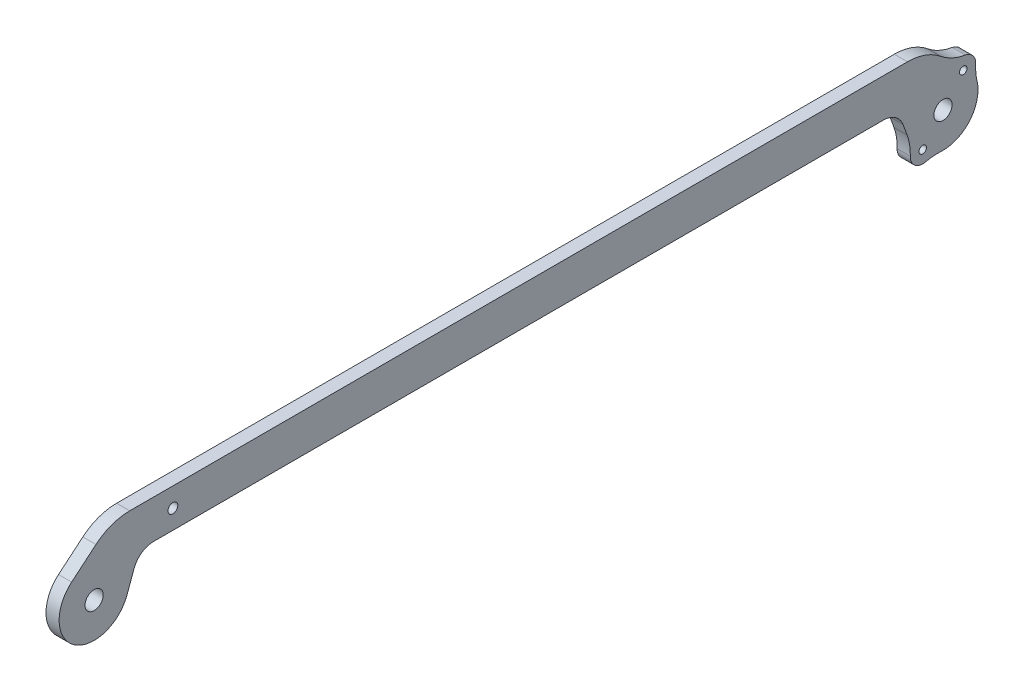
from build123d import *

# Parameters (mm, degrees)
SKETCH1_R           = 3.302
BOSS_EXTRUDE1_DEPTH = 4.7625
BOSS_EXTRUDE2_START = -4.7625
BOSS_EXTRUDE2_DEPTH = 4.7625
SKETCH2_3_R         = 1.35255
CUT_EXTRUDE3_DEPTH  = 322.436253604
FILLET1_R           = 19.05
SKETCH3_R           = 1.778
CUT_EXTRUDE4_DEPTH  = 322.436253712


with BuildPart() as part:
    # Sketch1 → Boss-Extrude1 (new body)
    with BuildSketch(Plane(origin=(0, 0, 0), x_dir=(0, 0, -1), z_dir=(1, 0, 0))):
        with BuildLine():
            Line((-8.163402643, 9.728764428), (5.972267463, 21.59))
            Line((5.972267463, 21.59), (302.002732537, 21.59))
            Line((302.002732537, 21.59), (316.138402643, 9.728764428))
            ThreePointArc((316.138402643, 9.728764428), (315.259420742, -10.403230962), (296.040903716, -4.34365582))
            Line((296.040903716, -4.34365582), (293.511365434, 2.606193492))
            ThreePointArc((293.511365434, 2.606193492), (290.721560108, 6.241938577), (286.350907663, 7.62))
            Line((286.350907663, 7.62), (21.624092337, 7.62))
            ThreePointArc((21.624092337, 7.62), (17.253439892, 6.241938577), (14.463634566, 2.606193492))
            Line((14.463634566, 2.606193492), (11.934096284, -4.34365582))
            ThreePointArc((11.934096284, -4.34365582), (-7.284420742, -10.403230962), (-8.163402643, 9.728764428))
        make_face()
        with Locations(Location((0, 0, 0), (0, 0, 180))):
            Circle(SKETCH1_R, mode=Mode.SUBTRACT)
        with Locations(Location((307.975, 0, 0), (0, 0, 180))):
            Circle(SKETCH1_R, mode=Mode.SUBTRACT)
    extrude(amount=BOSS_EXTRUDE1_DEPTH)

    # Sketch2 → Boss-Extrude2 (add)
    with BuildSketch(Plane(origin=(4.7625, 0, 0), x_dir=(0, 0, -1), z_dir=(1, 0, 0)).offset(BOSS_EXTRUDE2_START)):
        with BuildLine():
            ThreePointArc((316.138402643, 9.728764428), (316.324735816, 9.569321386), (316.507955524, 9.406310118))
            ThreePointArc((316.507955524, 9.406310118), (316.201689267, 9.783335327), (315.781972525, 10.027844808))
            Line((315.781972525, 10.027844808), (316.138402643, 9.728764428))
        make_face()
        with BuildLine():
            ThreePointArc((316.674612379, 8.755887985), (316.632285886, 9.091604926), (316.507955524, 9.406310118))
            ThreePointArc((316.507955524, 9.406310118), (316.324735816, 9.569321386), (316.138402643, 9.728764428))
            Line((316.138402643, 9.728764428), (315.781972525, 10.027844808))
            ThreePointArc((315.781972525, 10.027844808), (314.214939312, 7.978925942), (316.674612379, 8.755887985))
        make_face()
        with BuildLine():
            ThreePointArc((316.507955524, 9.406310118), (318.906268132, 6.465089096), (320.328453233, 2.946556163))
            ThreePointArc((320.328453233, 2.946556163), (319.881661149, 5.69994622), (319.841743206, 8.489065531))
            ThreePointArc((319.841743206, 8.489065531), (318.86294879, 11.5773827), (316.071151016, 13.221039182))
            ThreePointArc((316.071151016, 13.221039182), (311.243988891, 14.709996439), (306.977892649, 17.415344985))
            Line((306.977892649, 17.415344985), (315.781972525, 10.027844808))
            ThreePointArc((315.781972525, 10.027844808), (316.201689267, 9.783335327), (316.507955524, 9.406310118))
        make_face()
        with BuildLine():
            ThreePointArc((316.138402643, 9.728764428), (316.324735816, 9.569321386), (316.507955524, 9.406310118))
            ThreePointArc((316.507955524, 9.406310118), (316.201689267, 9.783335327), (315.781972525, 10.027844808))
            Line((315.781972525, 10.027844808), (316.138402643, 9.728764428))
        make_face()
        with BuildLine():
            ThreePointArc((316.674612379, 8.755887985), (316.632285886, 9.091604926), (316.507955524, 9.406310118))
            ThreePointArc((316.507955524, 9.406310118), (316.324735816, 9.569321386), (316.138402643, 9.728764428))
            Line((316.138402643, 9.728764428), (315.781972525, 10.027844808))
            ThreePointArc((315.781972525, 10.027844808), (314.214939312, 7.978925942), (316.674612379, 8.755887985))
        make_face()
        with BuildLine():
            Line((314.298811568, 4.345483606), (320.328453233, 2.946556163))
            ThreePointArc((320.328453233, 2.946556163), (318.906268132, 6.465089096), (316.507955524, 9.406310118))
            ThreePointArc((316.507955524, 9.406310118), (316.632285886, 9.091604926), (316.674612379, 8.755887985))
            ThreePointArc((316.674612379, 8.755887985), (314.214939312, 7.978925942), (315.781972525, 10.027844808))
            Line((315.781972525, 10.027844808), (306.977892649, 17.415344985))
            Line((306.977892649, 17.415344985), (311.118907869, 7.072973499))
            ThreePointArc((311.118907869, 7.072973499), (312.374414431, 5.319308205), (314.298811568, 4.345483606))
        make_face()
        with BuildLine():
            ThreePointArc((300.193325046, -10.036709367), (299.811597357, -9.728764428), (299.442044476, -9.406310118))
            ThreePointArc((299.442044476, -9.406310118), (299.75853524, -9.792001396), (300.193325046, -10.036709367))
        make_face()
        with BuildLine():
            ThreePointArc((301.980487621, -8.755887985), (300.29222068, -7.445664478), (299.442044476, -9.406310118))
            ThreePointArc((299.442044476, -9.406310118), (299.811597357, -9.728764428), (300.193325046, -10.036709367))
            ThreePointArc((300.193325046, -10.036709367), (301.415832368, -9.855257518), (301.980487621, -8.755887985))
        make_face()
        with BuildLine():
            Line((296.040903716, -4.34365582), (294.966782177, -1.392531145))
            ThreePointArc((294.966782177, -1.392531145), (295.882680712, -4.937931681), (296.103316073, -8.593072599))
            ThreePointArc((296.103316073, -8.593072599), (297.757758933, -12.257428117), (301.675540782, -13.160571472))
            ThreePointArc((301.675540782, -13.160571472), (304.429218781, -12.715557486), (307.218363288, -12.677440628))
            ThreePointArc((307.218363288, -12.677440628), (303.506324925, -11.887848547), (300.193325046, -10.036709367))
            ThreePointArc((300.193325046, -10.036709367), (299.75853524, -9.792001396), (299.442044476, -9.406310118))
            ThreePointArc((299.442044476, -9.406310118), (297.433051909, -7.082184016), (296.040903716, -4.34365582))
        make_face()
        with BuildLine():
            Line((302.416766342, -4.596705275), (294.966782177, -1.392531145))
            Line((294.966782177, -1.392531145), (296.040903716, -4.34365582))
            ThreePointArc((296.040903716, -4.34365582), (297.433051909, -7.082184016), (299.442044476, -9.406310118))
            ThreePointArc((299.442044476, -9.406310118), (300.29222068, -7.445664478), (301.980487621, -8.755887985))
            ThreePointArc((301.980487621, -8.755887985), (301.415832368, -9.855257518), (300.193325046, -10.036709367))
            ThreePointArc((300.193325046, -10.036709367), (303.506324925, -11.887848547), (307.218363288, -12.677440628))
            Line((307.218363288, -12.677440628), (304.793652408, -6.98232397))
            ThreePointArc((304.793652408, -6.98232397), (303.835263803, -5.560302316), (302.416766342, -4.596705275))
        make_face()
    extrude(amount=BOSS_EXTRUDE2_DEPTH)

    # Sketch2_3 → Cut-Extrude3 (cut, through all)
    with BuildSketch(Plane(origin=(4.7625, 0, 0), x_dir=(0, 0, -1), z_dir=(1, 0, 0))):
        with Locations((300.627937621, -8.755887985)):
            Circle(SKETCH2_3_R)
        with Locations((315.322062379, 8.755887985)):
            Circle(SKETCH2_3_R)
        with BuildLine():
            ThreePointArc((316.138402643, 9.728764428), (316.324735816, 9.569321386), (316.507955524, 9.406310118))
            ThreePointArc((316.507955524, 9.406310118), (316.201689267, 9.783335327), (315.781972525, 10.027844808))
            Line((315.781972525, 10.027844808), (316.138402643, 9.728764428))
        make_face()
        with BuildLine():
            ThreePointArc((316.674612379, 8.755887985), (316.632285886, 9.091604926), (316.507955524, 9.406310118))
            ThreePointArc((316.507955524, 9.406310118), (316.324735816, 9.569321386), (316.138402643, 9.728764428))
            Line((316.138402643, 9.728764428), (315.781972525, 10.027844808))
            ThreePointArc((315.781972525, 10.027844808), (314.214939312, 7.978925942), (316.674612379, 8.755887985))
        make_face()
        with BuildLine():
            ThreePointArc((299.442044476, -9.406310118), (299.75853524, -9.792001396), (300.193325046, -10.036709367))
            ThreePointArc((300.193325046, -10.036709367), (299.811597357, -9.728764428), (299.442044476, -9.406310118))
        make_face()
        with BuildLine():
            ThreePointArc((299.442044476, -9.406310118), (299.811597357, -9.728764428), (300.193325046, -10.036709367))
            ThreePointArc((300.193325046, -10.036709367), (301.415832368, -9.855257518), (301.980487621, -8.755887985))
            ThreePointArc((301.980487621, -8.755887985), (300.29222068, -7.445664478), (299.442044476, -9.406310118))
        make_face()
    extrude(amount=-CUT_EXTRUDE3_DEPTH, mode=Mode.SUBTRACT)

    # Fillet1
    fillet1_edges = [part.edges().sort_by_distance(p)[0] for p in [
        (2.38125, 21.59, -5.972267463),
        (2.38125, 21.59, -302.002732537),
    ]]
    fillet(fillet1_edges, radius=FILLET1_R)

    # Sketch3 → Cut-Extrude4 (cut, through all)
    with BuildSketch(Plane(origin=(4.7625, 0, 0), x_dir=(0, 0, -1), z_dir=(1, 0, 0))):
        with Locations((28.575, 14.605)):
            Circle(SKETCH3_R)
    extrude(amount=-CUT_EXTRUDE4_DEPTH, mode=Mode.SUBTRACT)


solid = part.part
